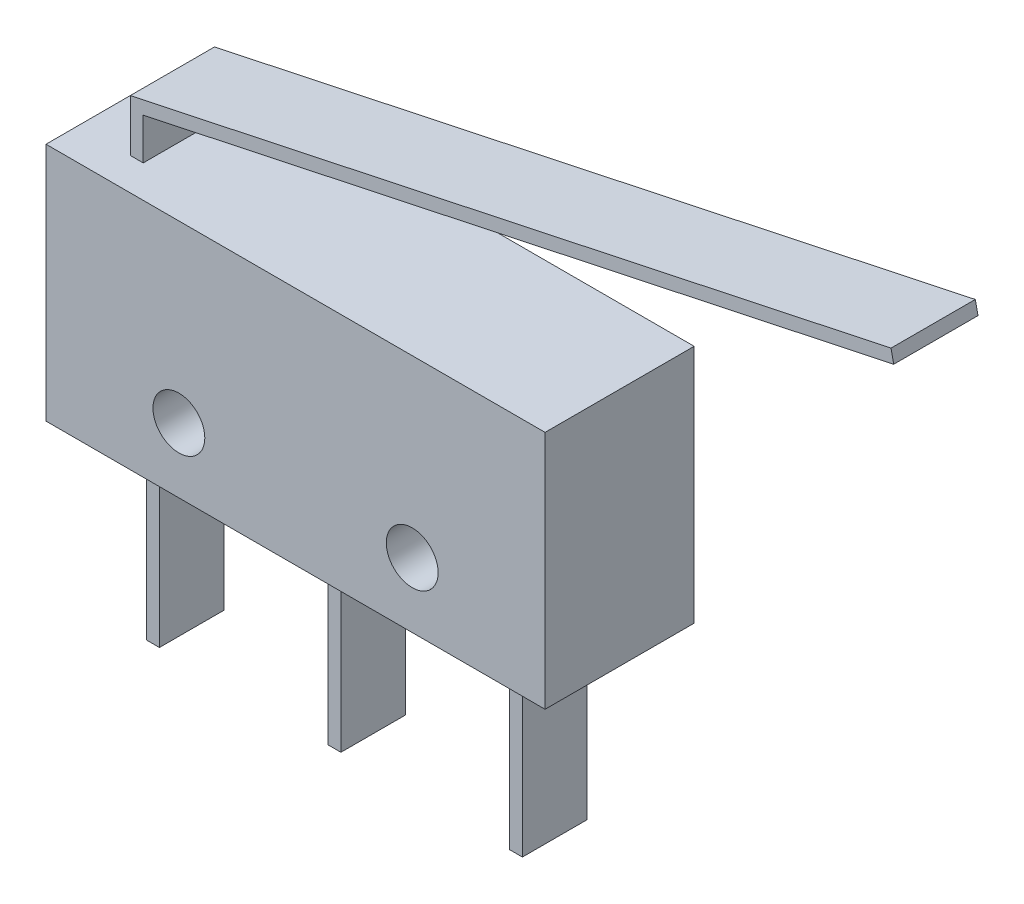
from build123d import *

# Parameters (mm, degrees)
SKETCH1_W           = 19.558
SKETCH1_H           = 9.398
BOSS_EXTRUDE1_DEPTH = 2.921
SKETCH2_R           = 1.016
CUT_EXTRUDE1_DEPTH  = 13.322272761
EXTRUDE_THIN1_DEPTH = 1.651
SKETCH4_W           = 0.508
SKETCH4_H           = 7.112
BOSS_EXTRUDE2_DEPTH = 1.27


with BuildPart() as part:
    # Sketch1 → Boss-Extrude1 (new, symmetric)
    with BuildSketch(Plane.XY):
        Rectangle(SKETCH1_W, SKETCH1_H)
    extrude(amount=BOSS_EXTRUDE1_DEPTH, both=True)

    # Sketch2 → Cut-Extrude1 (cut, through all)
    with BuildSketch(Plane.XY.offset(2.921)):
        with Locations((-4.572, -2.159)):
            Circle(SKETCH2_R)
        with Locations((4.572, -2.159)):
            Circle(SKETCH2_R)
    extrude(amount=-CUT_EXTRUDE1_DEPTH, mode=Mode.SUBTRACT)

    # Sketch4 → Boss-Extrude2 (add, symmetric)
    with BuildSketch(Plane.XY):
        with Locations((-7.239, -8.255)):
            Rectangle(SKETCH4_W, SKETCH4_H)
        with Locations((-0.127, -8.255)):
            Rectangle(SKETCH4_W, SKETCH4_H)
        with Locations((6.985, -8.255)):
            Rectangle(SKETCH4_W, SKETCH4_H)
    extrude(amount=BOSS_EXTRUDE2_DEPTH, both=True)


with BuildPart() as body_2:
    # Sketch3 → Extrude-Thin1 (new, symmetric)
    with BuildSketch(Plane.XY):
        Polygon((-7.747, 4.699), (-7.747, 6.731), (22.06693887, 13.068148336), (22.172558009, 12.571249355), (-7.239, 6.319629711), (-7.239, 4.699), align=None)
    extrude(amount=EXTRUDE_THIN1_DEPTH, both=True)


solid = Compound([part.part, body_2.part])
